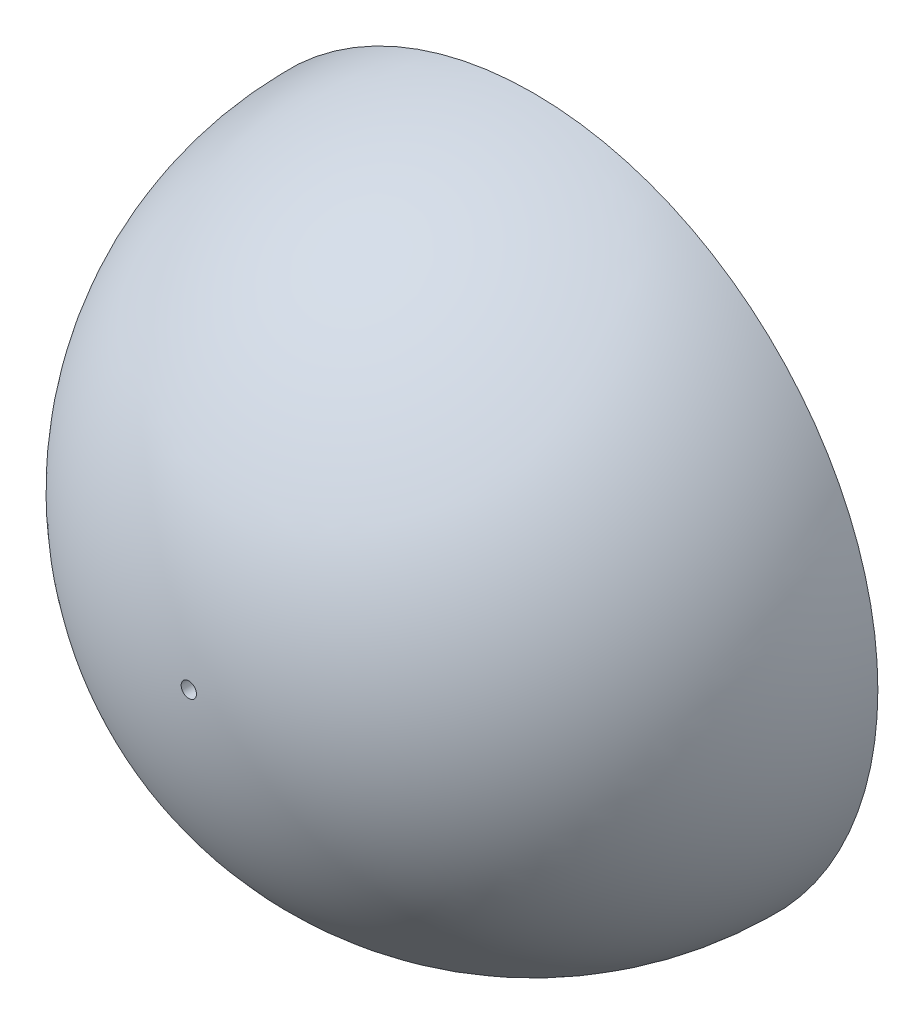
ISO-10303-21;
HEADER;
FILE_DESCRIPTION(('STEP AP214'),'2;1');
FILE_NAME('part.step','',(''),(''),'','','');
FILE_SCHEMA(('AUTOMOTIVE_DESIGN { 1 0 10303 214 1 1 1 1 }'));
ENDSEC;
DATA;
#1=APPLICATION_CONTEXT('core data for automotive mechanical design processes');
#2=APPLICATION_PROTOCOL_DEFINITION('international standard','automotive_design',2000,#1);
#3=PRODUCT_CONTEXT('',#1,'mechanical');
#4=PRODUCT('Part','Part','',(#3));
#5=PRODUCT_RELATED_PRODUCT_CATEGORY('part','',(#4));
#6=PRODUCT_DEFINITION_FORMATION('','',#4);
#7=PRODUCT_DEFINITION_CONTEXT('part definition',#1,'design');
#8=PRODUCT_DEFINITION('design','',#6,#7);
#9=PRODUCT_DEFINITION_SHAPE('','',#8);
#10=(LENGTH_UNIT() NAMED_UNIT(*) SI_UNIT(.MILLI.,.METRE.));
#11=(NAMED_UNIT(*) PLANE_ANGLE_UNIT() SI_UNIT($,.RADIAN.));
#12=(NAMED_UNIT(*) SI_UNIT($,.STERADIAN.) SOLID_ANGLE_UNIT());
#13=UNCERTAINTY_MEASURE_WITH_UNIT(LENGTH_MEASURE(1.E-05),#10,'distance_accuracy_value','');
#14=(GEOMETRIC_REPRESENTATION_CONTEXT(3) GLOBAL_UNCERTAINTY_ASSIGNED_CONTEXT((#13)) GLOBAL_UNIT_ASSIGNED_CONTEXT((#10,
#11,#12)) REPRESENTATION_CONTEXT('',''));
#15=CARTESIAN_POINT('',(0.,0.,0.));
#16=DIRECTION('',(0.,0.,1.));
#17=DIRECTION('',(1.,0.,0.));
#18=AXIS2_PLACEMENT_3D('',#15,#16,#17);
#19=CARTESIAN_POINT('',(0.,0.,131.998480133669));
#20=DIRECTION('',(0.,0.,-1.));
#21=DIRECTION('',(-1.,0.,0.));
#22=AXIS2_PLACEMENT_3D('',#19,#20,#21);
#23=CONICAL_SURFACE('',#22,1.66175,1.02974425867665);
#24=CARTESIAN_POINT('',(0.,0.,131.));
#25=DIRECTION('',(0.,0.,-1.));
#26=DIRECTION('',(-1.,0.,0.));
#27=AXIS2_PLACEMENT_3D('',#24,#25,#26);
#28=CIRCLE('',#27,3.3235);
#29=CARTESIAN_POINT('',(-3.3235,0.,131.));
#30=VERTEX_POINT('',#29);
#31=EDGE_CURVE('E10',#30,#30,#28,.T.);
#32=ORIENTED_EDGE('',*,*,#31,.T.);
#33=EDGE_LOOP('',(#32));
#34=FACE_BOUND('',#33,.T.);
#35=CARTESIAN_POINT('',(0.,0.,132.996960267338));
#36=VERTEX_POINT('',#35);
#37=VERTEX_LOOP('',#36);
#38=FACE_BOUND('',#37,.T.);
#39=ADVANCED_FACE('F15',(#34,#38),#23,.F.);
#40=CARTESIAN_POINT('',(0.,0.,125.5));
#41=DIRECTION('',(0.,0.,1.));
#42=DIRECTION('',(-1.,0.,0.));
#43=AXIS2_PLACEMENT_3D('',#40,#41,#42);
#44=CYLINDRICAL_SURFACE('',#43,3.3235);
#45=CARTESIAN_POINT('',(0.,0.,120.));
#46=DIRECTION('',(0.,0.,1.));
#47=DIRECTION('',(-1.,0.,0.));
#48=AXIS2_PLACEMENT_3D('',#45,#46,#47);
#49=CIRCLE('',#48,3.3235);
#50=CARTESIAN_POINT('',(-3.3235,0.,120.));
#51=VERTEX_POINT('',#50);
#52=EDGE_CURVE('E101',#51,#51,#49,.T.);
#53=ORIENTED_EDGE('',*,*,#52,.F.);
#54=EDGE_LOOP('',(#53));
#55=FACE_BOUND('',#54,.T.);
#56=ORIENTED_EDGE('',*,*,#31,.F.);
#57=EDGE_LOOP('',(#56));
#58=FACE_BOUND('',#57,.T.);
#59=ADVANCED_FACE('F139',(#55,#58),#44,.F.);
#60=CARTESIAN_POINT('',(0.,0.,136.001519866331));
#61=DIRECTION('',(0.,0.,1.));
#62=DIRECTION('',(-1.,0.,0.));
#63=AXIS2_PLACEMENT_3D('',#60,#61,#62);
#64=CONICAL_SURFACE('',#63,1.66175,1.02974425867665);
#65=CARTESIAN_POINT('',(0.,0.,137.));
#66=DIRECTION('',(0.,0.,-1.));
#67=DIRECTION('',(-1.,0.,0.));
#68=AXIS2_PLACEMENT_3D('',#65,#66,#67);
#69=CIRCLE('',#68,3.3235);
#70=CARTESIAN_POINT('',(-3.3235,0.,137.));
#71=VERTEX_POINT('',#70);
#72=EDGE_CURVE('E26',#71,#71,#69,.T.);
#73=ORIENTED_EDGE('',*,*,#72,.F.);
#74=EDGE_LOOP('',(#73));
#75=FACE_BOUND('',#74,.T.);
#76=CARTESIAN_POINT('',(0.,0.,135.003039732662));
#77=VERTEX_POINT('',#76);
#78=VERTEX_LOOP('',#77);
#79=FACE_BOUND('',#78,.T.);
#80=ADVANCED_FACE('F136',(#75,#79),#64,.F.);
#81=CARTESIAN_POINT('',(0.,0.,143.5));
#82=DIRECTION('',(0.,0.,1.));
#83=DIRECTION('',(-1.,0.,0.));
#84=AXIS2_PLACEMENT_3D('',#81,#82,#83);
#85=CYLINDRICAL_SURFACE('',#84,3.3235);
#86=CARTESIAN_POINT('',(0.,0.,149.9631766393));
#87=DIRECTION('',(0.,0.,-1.));
#88=DIRECTION('',(-1.,0.,0.));
#89=AXIS2_PLACEMENT_3D('',#86,#87,#88);
#90=CIRCLE('',#89,3.3235);
#91=CARTESIAN_POINT('',(3.3235,0.,149.9631766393));
#92=VERTEX_POINT('',#91);
#93=EDGE_CURVE('E102',#92,#92,#90,.T.);
#94=ORIENTED_EDGE('',*,*,#93,.F.);
#95=EDGE_LOOP('',(#94));
#96=FACE_BOUND('',#95,.T.);
#97=ORIENTED_EDGE('',*,*,#72,.T.);
#98=EDGE_LOOP('',(#97));
#99=FACE_BOUND('',#98,.T.);
#100=ADVANCED_FACE('F134',(#96,#99),#85,.F.);
#101=CARTESIAN_POINT('',(0.,148.5,0.));
#102=DIRECTION('',(0.,0.,-1.));
#103=DIRECTION('',(-1.,0.,0.));
#104=AXIS2_PLACEMENT_3D('',#101,#102,#103);
#105=PLANE('',#104);
#106=CARTESIAN_POINT('',(0.,0.,0.));
#107=DIRECTION('',(0.,0.,-1.));
#108=DIRECTION('',(1.,0.,0.));
#109=AXIS2_PLACEMENT_3D('',#106,#107,#108);
#110=CIRCLE('',#109,150.);
#111=CARTESIAN_POINT('',(0.,150.,0.));
#112=VERTEX_POINT('',#111);
#113=EDGE_CURVE('E84',#112,#112,#110,.T.);
#114=ORIENTED_EDGE('',*,*,#113,.T.);
#115=EDGE_LOOP('',(#114));
#116=FACE_BOUND('',#115,.T.);
#117=CARTESIAN_POINT('',(0.,0.,0.));
#118=DIRECTION('',(0.,0.,-1.));
#119=DIRECTION('',(1.,0.,0.));
#120=AXIS2_PLACEMENT_3D('',#117,#118,#119);
#121=CIRCLE('',#120,148.5);
#122=CARTESIAN_POINT('',(0.,148.5,0.));
#123=VERTEX_POINT('',#122);
#124=EDGE_CURVE('E80',#123,#123,#121,.T.);
#125=ORIENTED_EDGE('',*,*,#124,.F.);
#126=EDGE_LOOP('',(#125));
#127=FACE_BOUND('',#126,.T.);
#128=ADVANCED_FACE('F81',(#116,#127),#105,.T.);
#129=CARTESIAN_POINT('',(0.,0.,1.1));
#130=DIRECTION('',(0.,0.,1.));
#131=DIRECTION('',(0.,1.,0.));
#132=AXIS2_PLACEMENT_3D('',#129,#130,#131);
#133=CYLINDRICAL_SURFACE('',#132,148.5);
#134=ORIENTED_EDGE('',*,*,#124,.T.);
#135=EDGE_LOOP('',(#134));
#136=FACE_BOUND('',#135,.T.);
#137=CARTESIAN_POINT('',(0.,0.,2.2));
#138=DIRECTION('',(0.,0.,-1.));
#139=DIRECTION('',(1.,0.,0.));
#140=AXIS2_PLACEMENT_3D('',#137,#138,#139);
#141=CIRCLE('',#140,148.5);
#142=CARTESIAN_POINT('',(0.,148.5,2.2));
#143=VERTEX_POINT('',#142);
#144=EDGE_CURVE('E19',#143,#143,#141,.T.);
#145=ORIENTED_EDGE('',*,*,#144,.F.);
#146=EDGE_LOOP('',(#145));
#147=FACE_BOUND('',#146,.T.);
#148=ADVANCED_FACE('F166',(#136,#147),#133,.F.);
#149=CARTESIAN_POINT('',(0.,145.5,2.2));
#150=DIRECTION('',(0.,0.,-1.));
#151=DIRECTION('',(-1.,0.,0.));
#152=AXIS2_PLACEMENT_3D('',#149,#150,#151);
#153=PLANE('',#152);
#154=ORIENTED_EDGE('',*,*,#144,.T.);
#155=EDGE_LOOP('',(#154));
#156=FACE_BOUND('',#155,.T.);
#157=CARTESIAN_POINT('',(0.,0.,2.2));
#158=DIRECTION('',(0.,0.,-1.));
#159=DIRECTION('',(1.,0.,0.));
#160=AXIS2_PLACEMENT_3D('',#157,#158,#159);
#161=CIRCLE('',#160,145.5);
#162=CARTESIAN_POINT('',(0.,145.5,2.2));
#163=VERTEX_POINT('',#162);
#164=EDGE_CURVE('E95',#163,#163,#161,.T.);
#165=ORIENTED_EDGE('',*,*,#164,.F.);
#166=EDGE_LOOP('',(#165));
#167=FACE_BOUND('',#166,.T.);
#168=ADVANCED_FACE('F164',(#156,#167),#153,.T.);
#169=CARTESIAN_POINT('',(0.,0.,1.1));
#170=DIRECTION('',(0.,0.,1.));
#171=DIRECTION('',(0.,1.,0.));
#172=AXIS2_PLACEMENT_3D('',#169,#170,#171);
#173=CYLINDRICAL_SURFACE('',#172,145.5);
#174=ORIENTED_EDGE('',*,*,#164,.T.);
#175=EDGE_LOOP('',(#174));
#176=FACE_BOUND('',#175,.T.);
#177=CARTESIAN_POINT('',(0.,0.,0.));
#178=DIRECTION('',(0.,0.,-1.));
#179=DIRECTION('',(1.,0.,0.));
#180=AXIS2_PLACEMENT_3D('',#177,#178,#179);
#181=CIRCLE('',#180,145.5);
#182=CARTESIAN_POINT('',(0.,145.5,0.));
#183=VERTEX_POINT('',#182);
#184=EDGE_CURVE('E109',#183,#183,#181,.T.);
#185=ORIENTED_EDGE('',*,*,#184,.F.);
#186=EDGE_LOOP('',(#185));
#187=FACE_BOUND('',#186,.T.);
#188=ADVANCED_FACE('F160',(#176,#187),#173,.T.);
#189=CARTESIAN_POINT('',(0.,144.,0.));
#190=DIRECTION('',(0.,0.,-1.));
#191=DIRECTION('',(-1.,0.,0.));
#192=AXIS2_PLACEMENT_3D('',#189,#190,#191);
#193=PLANE('',#192);
#194=ORIENTED_EDGE('',*,*,#184,.T.);
#195=EDGE_LOOP('',(#194));
#196=FACE_BOUND('',#195,.T.);
#197=CARTESIAN_POINT('',(0.,0.,0.));
#198=DIRECTION('',(0.,0.,-1.));
#199=DIRECTION('',(1.,0.,0.));
#200=AXIS2_PLACEMENT_3D('',#197,#198,#199);
#201=CIRCLE('',#200,144.);
#202=CARTESIAN_POINT('',(0.,144.,0.));
#203=VERTEX_POINT('',#202);
#204=EDGE_CURVE('E106',#203,#203,#201,.T.);
#205=ORIENTED_EDGE('',*,*,#204,.F.);
#206=EDGE_LOOP('',(#205));
#207=FACE_BOUND('',#206,.T.);
#208=ADVANCED_FACE('F163',(#196,#207),#193,.T.);
#209=CARTESIAN_POINT('',(0.,0.,4.));
#210=DIRECTION('',(0.,0.,1.));
#211=DIRECTION('',(0.,1.,0.));
#212=AXIS2_PLACEMENT_3D('',#209,#210,#211);
#213=CYLINDRICAL_SURFACE('',#212,144.);
#214=ORIENTED_EDGE('',*,*,#204,.T.);
#215=EDGE_LOOP('',(#214));
#216=FACE_BOUND('',#215,.T.);
#217=CARTESIAN_POINT('',(0.,0.,8.));
#218=DIRECTION('',(0.,0.,-1.));
#219=DIRECTION('',(1.,0.,0.));
#220=AXIS2_PLACEMENT_3D('',#217,#218,#219);
#221=CIRCLE('',#220,144.);
#222=CARTESIAN_POINT('',(0.,144.,8.));
#223=VERTEX_POINT('',#222);
#224=EDGE_CURVE('E98',#223,#223,#221,.T.);
#225=ORIENTED_EDGE('',*,*,#224,.F.);
#226=EDGE_LOOP('',(#225));
#227=FACE_BOUND('',#226,.T.);
#228=ADVANCED_FACE('F188',(#216,#227),#213,.F.);
#229=CARTESIAN_POINT('',(0.,138.,8.));
#230=DIRECTION('',(0.,0.,-1.));
#231=DIRECTION('',(-1.,0.,0.));
#232=AXIS2_PLACEMENT_3D('',#229,#230,#231);
#233=PLANE('',#232);
#234=ORIENTED_EDGE('',*,*,#224,.T.);
#235=EDGE_LOOP('',(#234));
#236=FACE_BOUND('',#235,.T.);
#237=CARTESIAN_POINT('',(0.,0.,8.));
#238=DIRECTION('',(0.,0.,-1.));
#239=DIRECTION('',(1.,0.,0.));
#240=AXIS2_PLACEMENT_3D('',#237,#238,#239);
#241=CIRCLE('',#240,138.);
#242=CARTESIAN_POINT('',(0.,138.,8.));
#243=VERTEX_POINT('',#242);
#244=EDGE_CURVE('E116',#243,#243,#241,.T.);
#245=ORIENTED_EDGE('',*,*,#244,.F.);
#246=EDGE_LOOP('',(#245));
#247=FACE_BOUND('',#246,.T.);
#248=ADVANCED_FACE('F182',(#236,#247),#233,.T.);
#249=CARTESIAN_POINT('',(0.,0.,27.832750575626));
#250=DIRECTION('',(0.,0.,1.));
#251=DIRECTION('',(0.,1.,0.));
#252=AXIS2_PLACEMENT_3D('',#249,#250,#251);
#253=CYLINDRICAL_SURFACE('',#252,138.);
#254=ORIENTED_EDGE('',*,*,#244,.T.);
#255=EDGE_LOOP('',(#254));
#256=FACE_BOUND('',#255,.T.);
#257=CARTESIAN_POINT('',(0.,0.,47.665501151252));
#258=DIRECTION('',(0.,0.,-1.));
#259=DIRECTION('',(1.,0.,0.));
#260=AXIS2_PLACEMENT_3D('',#257,#258,#259);
#261=CIRCLE('',#260,138.);
#262=CARTESIAN_POINT('',(0.,138.,47.665501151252));
#263=VERTEX_POINT('',#262);
#264=EDGE_CURVE('E72',#263,#263,#261,.T.);
#265=ORIENTED_EDGE('',*,*,#264,.F.);
#266=EDGE_LOOP('',(#265));
#267=FACE_BOUND('',#266,.T.);
#268=ADVANCED_FACE('F174',(#256,#267),#253,.F.);
#269=CARTESIAN_POINT('',(0.,0.,0.));
#270=DIRECTION('',(0.,0.,1.));
#271=DIRECTION('',(1.,0.,0.));
#272=AXIS2_PLACEMENT_3D('',#269,#270,#271);
#273=SPHERICAL_SURFACE('',#272,146.);
#274=ORIENTED_EDGE('',*,*,#264,.T.);
#275=EDGE_LOOP('',(#274));
#276=FACE_BOUND('',#275,.T.);
#277=CARTESIAN_POINT('',(0.,0.,120.));
#278=DIRECTION('',(0.,0.,-1.));
#279=DIRECTION('',(1.,0.,0.));
#280=AXIS2_PLACEMENT_3D('',#277,#278,#279);
#281=CIRCLE('',#280,83.1624915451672);
#282=CARTESIAN_POINT('',(0.,83.1624915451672,120.));
#283=VERTEX_POINT('',#282);
#284=EDGE_CURVE('E68',#283,#283,#281,.T.);
#285=ORIENTED_EDGE('',*,*,#284,.F.);
#286=EDGE_LOOP('',(#285));
#287=FACE_BOUND('',#286,.T.);
#288=ADVANCED_FACE('F172',(#276,#287),#273,.F.);
#289=CARTESIAN_POINT('',(0.,0.,120.));
#290=DIRECTION('',(0.,0.,-1.));
#291=DIRECTION('',(-1.,0.,0.));
#292=AXIS2_PLACEMENT_3D('',#289,#290,#291);
#293=PLANE('',#292);
#294=ORIENTED_EDGE('',*,*,#52,.T.);
#295=EDGE_LOOP('',(#294));
#296=FACE_BOUND('',#295,.T.);
#297=ORIENTED_EDGE('',*,*,#284,.T.);
#298=EDGE_LOOP('',(#297));
#299=FACE_BOUND('',#298,.T.);
#300=ADVANCED_FACE('F17',(#296,#299),#293,.T.);
#301=CARTESIAN_POINT('',(0.,0.,0.));
#302=DIRECTION('',(0.,0.,1.));
#303=DIRECTION('',(1.,0.,0.));
#304=AXIS2_PLACEMENT_3D('',#301,#302,#303);
#305=SPHERICAL_SURFACE('',#304,150.);
#306=ORIENTED_EDGE('',*,*,#93,.T.);
#307=EDGE_LOOP('',(#306));
#308=FACE_BOUND('',#307,.T.);
#309=ORIENTED_EDGE('',*,*,#113,.F.);
#310=EDGE_LOOP('',(#309));
#311=FACE_BOUND('',#310,.T.);
#312=ADVANCED_FACE('F169',(#308,#311),#305,.T.);
#313=CLOSED_SHELL('',(#39,#59,#80,#100,#128,#148,#168,#188,#208,#228,#248,#268,#288,#300,#312));
#314=MANIFOLD_SOLID_BREP('B1',#313);
#315=ADVANCED_BREP_SHAPE_REPRESENTATION('',(#18,#314),#14);
#316=SHAPE_DEFINITION_REPRESENTATION(#9,#315);
ENDSEC;
END-ISO-10303-21;
